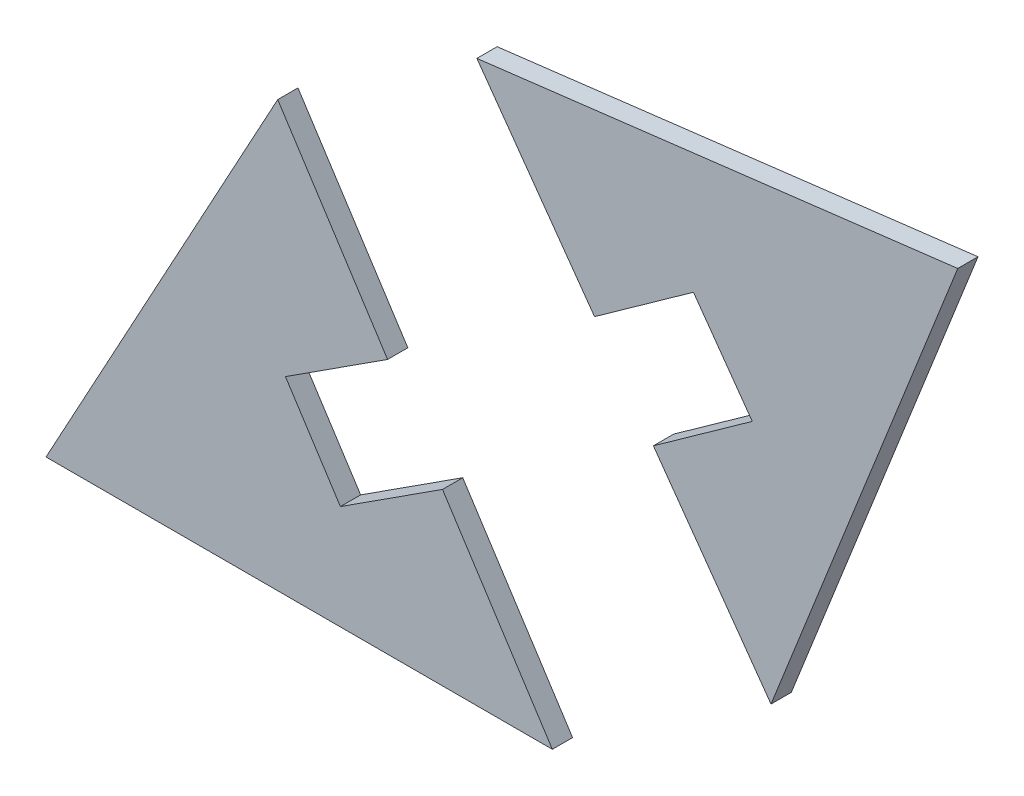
from build123d import *

# Parameters (mm, degrees)
BOSS_EXTRUDE1_DEPTH   = 2
BOSS_EXTRUDE1_2_DEPTH = 2


with BuildPart() as part:
    # Sketch1 → Boss-Extrude1 (new body)
    with BuildSketch(Plane.XY):
        Polygon((-16.29727801, 32.991130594), (-39.17932511, -9.016209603), (10.82067489, -9.016209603), (-0.02650627, 7.786726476), (-10.108267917, 1.27841778), (-15.531858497, 9.679885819), (-5.45009685, 16.188194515), align=None)
    extrude(amount=BOSS_EXTRUDE1_DEPTH)


with BuildPart() as body_2:
    # Sketch1 → Boss-Extrude1 2 (new body)
    with BuildSketch(Plane.XY):
        Polygon((14.988833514, 30.068047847), (3.370336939, 46.347192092), (50.855263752, 52.125291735), (32.416578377, 5.64933148), (20.798081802, 21.928475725), (30.565568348, 28.89957367), (24.756320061, 37.039145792), align=None)
    extrude(amount=BOSS_EXTRUDE1_2_DEPTH)


solid = Compound([part.part, body_2.part])
